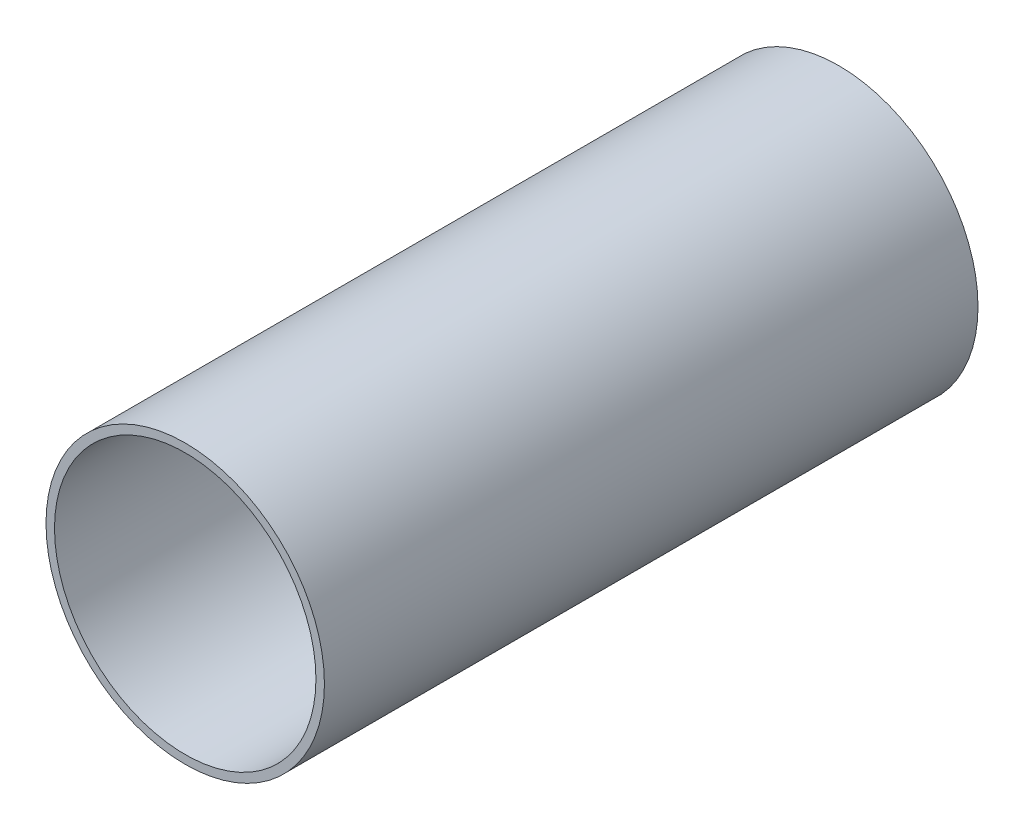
from build123d import *

# Parameters (mm, degrees)
SKETCH1_R      = 27.051
SKETCH1_R_2    = 25.4
EXTRUDE1_DEPTH = 127


with BuildPart() as part:
    # Sketch1 → Extrude1 (new body)
    with BuildSketch(Plane.XY):
        Circle(SKETCH1_R)
        Circle(SKETCH1_R_2, mode=Mode.SUBTRACT)
    extrude(amount=EXTRUDE1_DEPTH)


solid = part.part
